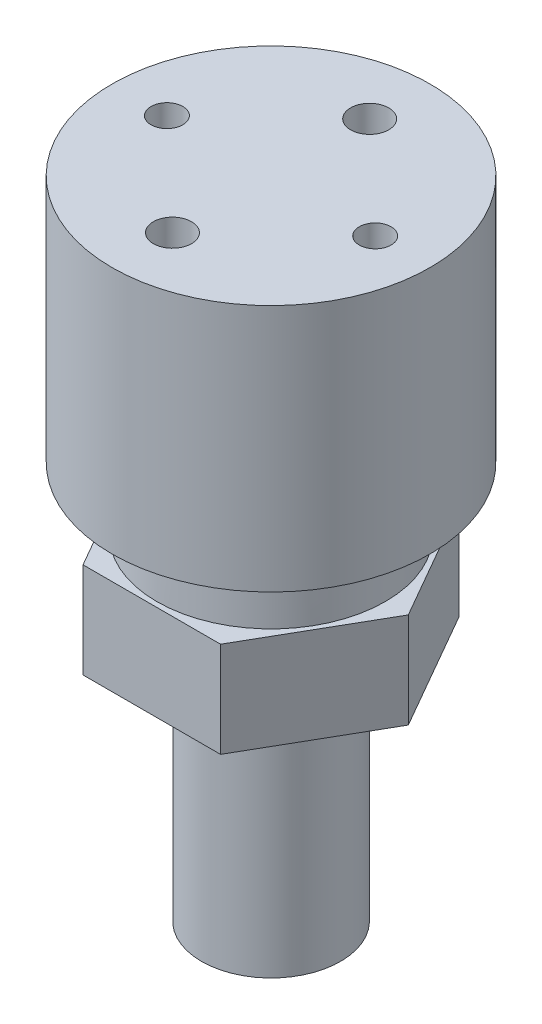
ISO-10303-21;
HEADER;
FILE_DESCRIPTION(('STEP AP214'),'2;1');
FILE_NAME('part.step','',(''),(''),'','','');
FILE_SCHEMA(('AUTOMOTIVE_DESIGN { 1 0 10303 214 1 1 1 1 }'));
ENDSEC;
DATA;
#1=APPLICATION_CONTEXT('core data for automotive mechanical design processes');
#2=APPLICATION_PROTOCOL_DEFINITION('international standard','automotive_design',2000,#1);
#3=PRODUCT_CONTEXT('',#1,'mechanical');
#4=PRODUCT('Part','Part','',(#3));
#5=PRODUCT_RELATED_PRODUCT_CATEGORY('part','',(#4));
#6=PRODUCT_DEFINITION_FORMATION('','',#4);
#7=PRODUCT_DEFINITION_CONTEXT('part definition',#1,'design');
#8=PRODUCT_DEFINITION('design','',#6,#7);
#9=PRODUCT_DEFINITION_SHAPE('','',#8);
#10=(LENGTH_UNIT() NAMED_UNIT(*) SI_UNIT(.MILLI.,.METRE.));
#11=(NAMED_UNIT(*) PLANE_ANGLE_UNIT() SI_UNIT($,.RADIAN.));
#12=(NAMED_UNIT(*) SI_UNIT($,.STERADIAN.) SOLID_ANGLE_UNIT());
#13=UNCERTAINTY_MEASURE_WITH_UNIT(LENGTH_MEASURE(1.E-05),#10,'distance_accuracy_value','');
#14=(GEOMETRIC_REPRESENTATION_CONTEXT(3) GLOBAL_UNCERTAINTY_ASSIGNED_CONTEXT((#13)) GLOBAL_UNIT_ASSIGNED_CONTEXT((#10,
#11,#12)) REPRESENTATION_CONTEXT('',''));
#15=CARTESIAN_POINT('',(0.,0.,0.));
#16=DIRECTION('',(0.,0.,1.));
#17=DIRECTION('',(1.,0.,0.));
#18=AXIS2_PLACEMENT_3D('',#15,#16,#17);
#19=CARTESIAN_POINT('',(-12.7,24.8908107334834,0.));
#20=DIRECTION('',(0.,1.,0.));
#21=DIRECTION('',(0.,0.,1.));
#22=AXIS2_PLACEMENT_3D('',#19,#20,#21);
#23=PLANE('',#22);
#24=CARTESIAN_POINT('',(0.,24.8908107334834,-7.874));
#25=DIRECTION('',(0.,-1.,0.));
#26=DIRECTION('',(0.,0.,-1.));
#27=AXIS2_PLACEMENT_3D('',#24,#25,#26);
#28=CIRCLE('',#27,1.524);
#29=CARTESIAN_POINT('',(0.,24.8908107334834,-9.398));
#30=VERTEX_POINT('',#29);
#31=EDGE_CURVE('E144',#30,#30,#28,.T.);
#32=ORIENTED_EDGE('',*,*,#31,.T.);
#33=EDGE_LOOP('',(#32));
#34=FACE_BOUND('',#33,.T.);
#35=CARTESIAN_POINT('',(8.316893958,24.8908107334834,0.));
#36=DIRECTION('',(0.,1.,0.));
#37=DIRECTION('',(0.,0.,1.));
#38=AXIS2_PLACEMENT_3D('',#35,#36,#37);
#39=CIRCLE('',#38,1.27);
#40=CARTESIAN_POINT('',(8.316893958,24.8908107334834,1.27));
#41=VERTEX_POINT('',#40);
#42=EDGE_CURVE('E150',#41,#41,#39,.T.);
#43=ORIENTED_EDGE('',*,*,#42,.F.);
#44=EDGE_LOOP('',(#43));
#45=FACE_BOUND('',#44,.T.);
#46=CARTESIAN_POINT('',(0.,24.8908107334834,7.874));
#47=DIRECTION('',(0.,1.,0.));
#48=DIRECTION('',(0.,0.,1.));
#49=AXIS2_PLACEMENT_3D('',#46,#47,#48);
#50=CIRCLE('',#49,1.524);
#51=CARTESIAN_POINT('',(0.,24.8908107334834,9.398));
#52=VERTEX_POINT('',#51);
#53=EDGE_CURVE('E156',#52,#52,#50,.T.);
#54=ORIENTED_EDGE('',*,*,#53,.F.);
#55=EDGE_LOOP('',(#54));
#56=FACE_BOUND('',#55,.T.);
#57=CARTESIAN_POINT('',(0.,24.8908107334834,0.));
#58=DIRECTION('',(0.,1.,0.));
#59=DIRECTION('',(0.,0.,1.));
#60=AXIS2_PLACEMENT_3D('',#57,#58,#59);
#61=CIRCLE('',#60,12.7);
#62=CARTESIAN_POINT('',(0.,24.8908107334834,12.7));
#63=VERTEX_POINT('',#62);
#64=EDGE_CURVE('E39',#63,#63,#61,.T.);
#65=ORIENTED_EDGE('',*,*,#64,.T.);
#66=EDGE_LOOP('',(#65));
#67=FACE_BOUND('',#66,.T.);
#68=CARTESIAN_POINT('',(-8.316893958,24.8908107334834,0.));
#69=DIRECTION('',(0.,-1.,0.));
#70=DIRECTION('',(0.,0.,1.));
#71=AXIS2_PLACEMENT_3D('',#68,#69,#70);
#72=CIRCLE('',#71,1.27);
#73=CARTESIAN_POINT('',(-8.316893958,24.8908107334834,1.27));
#74=VERTEX_POINT('',#73);
#75=EDGE_CURVE('E268',#74,#74,#72,.T.);
#76=ORIENTED_EDGE('',*,*,#75,.T.);
#77=EDGE_LOOP('',(#76));
#78=FACE_BOUND('',#77,.T.);
#79=ADVANCED_FACE('F32',(#34,#45,#56,#67,#78),#23,.T.);
#80=CARTESIAN_POINT('',(5.49172751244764,-7.62000000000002,-9.525));
#81=DIRECTION('',(0.,1.,0.));
#82=DIRECTION('',(0.,0.,1.));
#83=AXIS2_PLACEMENT_3D('',#80,#81,#82);
#84=PLANE('',#83);
#85=DIRECTION('',(0.497936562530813,0.,0.867213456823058));
#86=VECTOR('',#85,1.);
#87=CARTESIAN_POINT('',(10.9607913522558,-7.62000000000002,0.));
#88=LINE('',#87,#86);
#89=CARTESIAN_POINT('',(5.49172751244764,-7.62000000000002,-9.525));
#90=VERTEX_POINT('',#89);
#91=CARTESIAN_POINT('',(10.9607913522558,-7.62000000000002,0.));
#92=VERTEX_POINT('',#91);
#93=EDGE_CURVE('E122',#90,#92,#88,.T.);
#94=ORIENTED_EDGE('',*,*,#93,.T.);
#95=DIRECTION('',(-0.497936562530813,0.,0.867213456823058));
#96=VECTOR('',#95,1.);
#97=CARTESIAN_POINT('',(10.9607913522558,-7.62000000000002,0.));
#98=LINE('',#97,#96);
#99=CARTESIAN_POINT('',(5.49172751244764,-7.62000000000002,9.525));
#100=VERTEX_POINT('',#99);
#101=EDGE_CURVE('E99',#92,#100,#98,.T.);
#102=ORIENTED_EDGE('',*,*,#101,.T.);
#103=DIRECTION('',(-1.,0.,0.));
#104=VECTOR('',#103,1.);
#105=CARTESIAN_POINT('',(5.49172751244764,-7.62000000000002,9.525));
#106=LINE('',#105,#104);
#107=CARTESIAN_POINT('',(-5.49172751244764,-7.62000000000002,9.525));
#108=VERTEX_POINT('',#107);
#109=EDGE_CURVE('E125',#100,#108,#106,.T.);
#110=ORIENTED_EDGE('',*,*,#109,.T.);
#111=DIRECTION('',(-0.497936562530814,0.,-0.867213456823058));
#112=VECTOR('',#111,1.);
#113=CARTESIAN_POINT('',(-10.9607913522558,-7.62000000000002,0.));
#114=LINE('',#113,#112);
#115=CARTESIAN_POINT('',(-10.9607913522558,-7.62000000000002,0.));
#116=VERTEX_POINT('',#115);
#117=EDGE_CURVE('E127',#108,#116,#114,.T.);
#118=ORIENTED_EDGE('',*,*,#117,.T.);
#119=DIRECTION('',(0.497936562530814,0.,-0.867213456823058));
#120=VECTOR('',#119,1.);
#121=CARTESIAN_POINT('',(-10.9607913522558,-7.62000000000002,0.));
#122=LINE('',#121,#120);
#123=CARTESIAN_POINT('',(-5.49172751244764,-7.62000000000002,-9.525));
#124=VERTEX_POINT('',#123);
#125=EDGE_CURVE('E51',#116,#124,#122,.T.);
#126=ORIENTED_EDGE('',*,*,#125,.T.);
#127=DIRECTION('',(1.,0.,0.));
#128=VECTOR('',#127,1.);
#129=CARTESIAN_POINT('',(5.49172751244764,-7.62000000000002,-9.525));
#130=LINE('',#129,#128);
#131=EDGE_CURVE('E46',#124,#90,#130,.T.);
#132=ORIENTED_EDGE('',*,*,#131,.T.);
#133=EDGE_LOOP('',(#94,#102,#110,#118,#126,#132));
#134=FACE_BOUND('',#133,.T.);
#135=CARTESIAN_POINT('',(0.,-7.62000000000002,0.));
#136=DIRECTION('',(0.,1.,0.));
#137=DIRECTION('',(0.,0.,1.));
#138=AXIS2_PLACEMENT_3D('',#135,#136,#137);
#139=CIRCLE('',#138,5.55625);
#140=CARTESIAN_POINT('',(0.,-7.62000000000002,5.55625));
#141=VERTEX_POINT('',#140);
#142=EDGE_CURVE('E11',#141,#141,#139,.F.);
#143=ORIENTED_EDGE('',*,*,#142,.F.);
#144=EDGE_LOOP('',(#143));
#145=FACE_BOUND('',#144,.T.);
#146=ADVANCED_FACE('F175',(#134,#145),#84,.F.);
#147=CARTESIAN_POINT('',(0.,55.728152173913,0.));
#148=DIRECTION('',(0.,1.,0.));
#149=DIRECTION('',(0.,0.,1.));
#150=AXIS2_PLACEMENT_3D('',#147,#148,#149);
#151=CYLINDRICAL_SURFACE('',#150,12.7);
#152=CARTESIAN_POINT('',(0.,5.07881073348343,0.));
#153=DIRECTION('',(0.,1.,0.));
#154=DIRECTION('',(0.,0.,1.));
#155=AXIS2_PLACEMENT_3D('',#152,#153,#154);
#156=CIRCLE('',#155,12.7);
#157=CARTESIAN_POINT('',(0.,5.07881073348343,12.7));
#158=VERTEX_POINT('',#157);
#159=EDGE_CURVE('E165',#158,#158,#156,.T.);
#160=ORIENTED_EDGE('',*,*,#159,.T.);
#161=EDGE_LOOP('',(#160));
#162=FACE_BOUND('',#161,.T.);
#163=ORIENTED_EDGE('',*,*,#64,.F.);
#164=EDGE_LOOP('',(#163));
#165=FACE_BOUND('',#164,.T.);
#166=ADVANCED_FACE('F172',(#162,#165),#151,.T.);
#167=CARTESIAN_POINT('',(-9.015021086,5.07881073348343,0.));
#168=DIRECTION('',(0.,-1.,0.));
#169=DIRECTION('',(0.,0.,-1.));
#170=AXIS2_PLACEMENT_3D('',#167,#168,#169);
#171=PLANE('',#170);
#172=CARTESIAN_POINT('',(0.,5.07881073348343,0.));
#173=DIRECTION('',(0.,1.,0.));
#174=DIRECTION('',(0.,0.,1.));
#175=AXIS2_PLACEMENT_3D('',#172,#173,#174);
#176=CIRCLE('',#175,9.015021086);
#177=CARTESIAN_POINT('',(0.,5.07881073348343,9.015021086));
#178=VERTEX_POINT('',#177);
#179=EDGE_CURVE('E162',#178,#178,#176,.T.);
#180=ORIENTED_EDGE('',*,*,#179,.T.);
#181=EDGE_LOOP('',(#180));
#182=FACE_BOUND('',#181,.T.);
#183=ORIENTED_EDGE('',*,*,#159,.F.);
#184=EDGE_LOOP('',(#183));
#185=FACE_BOUND('',#184,.T.);
#186=ADVANCED_FACE('F174',(#182,#185),#171,.T.);
#187=CARTESIAN_POINT('',(0.,5.07881073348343,0.));
#188=DIRECTION('',(0.,-1.,0.));
#189=DIRECTION('',(0.,0.,-1.));
#190=AXIS2_PLACEMENT_3D('',#187,#188,#189);
#191=CONICAL_SURFACE('',#190,9.015021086,0.0216387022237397);
#192=CARTESIAN_POINT('',(0.,0.,0.));
#193=DIRECTION('',(0.,1.,0.));
#194=DIRECTION('',(0.,0.,1.));
#195=AXIS2_PLACEMENT_3D('',#192,#193,#194);
#196=CIRCLE('',#195,9.12493711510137);
#197=CARTESIAN_POINT('',(0.,0.,9.12493711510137));
#198=VERTEX_POINT('',#197);
#199=EDGE_CURVE('E102',#198,#198,#196,.F.);
#200=ORIENTED_EDGE('',*,*,#199,.F.);
#201=EDGE_LOOP('',(#200));
#202=FACE_BOUND('',#201,.T.);
#203=ORIENTED_EDGE('',*,*,#179,.F.);
#204=EDGE_LOOP('',(#203));
#205=FACE_BOUND('',#204,.T.);
#206=ADVANCED_FACE('F181',(#202,#205),#191,.T.);
#207=CARTESIAN_POINT('',(0.,12.1908107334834,7.874));
#208=DIRECTION('',(0.,1.,0.));
#209=DIRECTION('',(0.,0.,1.));
#210=AXIS2_PLACEMENT_3D('',#207,#208,#209);
#211=CYLINDRICAL_SURFACE('',#210,1.524);
#212=CARTESIAN_POINT('',(0.,12.1908107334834,7.874));
#213=DIRECTION('',(0.,1.,0.));
#214=DIRECTION('',(0.,0.,1.));
#215=AXIS2_PLACEMENT_3D('',#212,#213,#214);
#216=CIRCLE('',#215,1.524);
#217=CARTESIAN_POINT('',(0.,12.1908107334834,9.398));
#218=VERTEX_POINT('',#217);
#219=EDGE_CURVE('E159',#218,#218,#216,.T.);
#220=ORIENTED_EDGE('',*,*,#219,.F.);
#221=EDGE_LOOP('',(#220));
#222=FACE_BOUND('',#221,.T.);
#223=ORIENTED_EDGE('',*,*,#53,.T.);
#224=EDGE_LOOP('',(#223));
#225=FACE_BOUND('',#224,.T.);
#226=ADVANCED_FACE('F195',(#222,#225),#211,.F.);
#227=CARTESIAN_POINT('',(0.,12.1908107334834,7.874));
#228=DIRECTION('',(0.,1.,0.));
#229=DIRECTION('',(0.,0.,1.));
#230=AXIS2_PLACEMENT_3D('',#227,#228,#229);
#231=PLANE('',#230);
#232=ORIENTED_EDGE('',*,*,#219,.T.);
#233=EDGE_LOOP('',(#232));
#234=FACE_BOUND('',#233,.T.);
#235=ADVANCED_FACE('F197',(#234),#231,.T.);
#236=CARTESIAN_POINT('',(8.316893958,12.1908107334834,0.));
#237=DIRECTION('',(0.,1.,0.));
#238=DIRECTION('',(0.,0.,1.));
#239=AXIS2_PLACEMENT_3D('',#236,#237,#238);
#240=CYLINDRICAL_SURFACE('',#239,1.27);
#241=CARTESIAN_POINT('',(8.316893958,12.1908107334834,0.));
#242=DIRECTION('',(0.,1.,0.));
#243=DIRECTION('',(0.,0.,1.));
#244=AXIS2_PLACEMENT_3D('',#241,#242,#243);
#245=CIRCLE('',#244,1.27);
#246=CARTESIAN_POINT('',(8.316893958,12.1908107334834,1.27));
#247=VERTEX_POINT('',#246);
#248=EDGE_CURVE('E153',#247,#247,#245,.T.);
#249=ORIENTED_EDGE('',*,*,#248,.F.);
#250=EDGE_LOOP('',(#249));
#251=FACE_BOUND('',#250,.T.);
#252=ORIENTED_EDGE('',*,*,#42,.T.);
#253=EDGE_LOOP('',(#252));
#254=FACE_BOUND('',#253,.T.);
#255=ADVANCED_FACE('F204',(#251,#254),#240,.F.);
#256=CARTESIAN_POINT('',(8.316893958,12.1908107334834,0.));
#257=DIRECTION('',(0.,1.,0.));
#258=DIRECTION('',(0.,0.,1.));
#259=AXIS2_PLACEMENT_3D('',#256,#257,#258);
#260=PLANE('',#259);
#261=ORIENTED_EDGE('',*,*,#248,.T.);
#262=EDGE_LOOP('',(#261));
#263=FACE_BOUND('',#262,.T.);
#264=ADVANCED_FACE('F213',(#263),#260,.T.);
#265=CARTESIAN_POINT('',(0.,12.1908107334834,-7.874));
#266=DIRECTION('',(0.,1.,0.));
#267=DIRECTION('',(0.,0.,1.));
#268=AXIS2_PLACEMENT_3D('',#265,#266,#267);
#269=CYLINDRICAL_SURFACE('',#268,1.524);
#270=CARTESIAN_POINT('',(0.,12.1908107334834,-7.874));
#271=DIRECTION('',(0.,-1.,0.));
#272=DIRECTION('',(0.,0.,-1.));
#273=AXIS2_PLACEMENT_3D('',#270,#271,#272);
#274=CIRCLE('',#273,1.524);
#275=CARTESIAN_POINT('',(0.,12.1908107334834,-9.398));
#276=VERTEX_POINT('',#275);
#277=EDGE_CURVE('E147',#276,#276,#274,.T.);
#278=ORIENTED_EDGE('',*,*,#277,.T.);
#279=EDGE_LOOP('',(#278));
#280=FACE_BOUND('',#279,.T.);
#281=ORIENTED_EDGE('',*,*,#31,.F.);
#282=EDGE_LOOP('',(#281));
#283=FACE_BOUND('',#282,.T.);
#284=ADVANCED_FACE('F217',(#280,#283),#269,.F.);
#285=CARTESIAN_POINT('',(0.,12.1908107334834,-7.874));
#286=DIRECTION('',(0.,1.,0.));
#287=DIRECTION('',(0.,0.,-1.));
#288=AXIS2_PLACEMENT_3D('',#285,#286,#287);
#289=PLANE('',#288);
#290=ORIENTED_EDGE('',*,*,#277,.F.);
#291=EDGE_LOOP('',(#290));
#292=FACE_BOUND('',#291,.T.);
#293=ADVANCED_FACE('F221',(#292),#289,.T.);
#294=CARTESIAN_POINT('',(10.9607913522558,-7.62000000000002,0.));
#295=DIRECTION('',(-0.867213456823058,0.,0.497936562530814));
#296=DIRECTION('',(0.497936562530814,0.,0.867213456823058));
#297=AXIS2_PLACEMENT_3D('',#294,#295,#296);
#298=PLANE('',#297);
#299=DIRECTION('',(0.497936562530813,0.,0.867213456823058));
#300=VECTOR('',#299,1.);
#301=CARTESIAN_POINT('',(10.9607913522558,0.,0.));
#302=LINE('',#301,#300);
#303=CARTESIAN_POINT('',(5.49172751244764,0.,-9.525));
#304=VERTEX_POINT('',#303);
#305=CARTESIAN_POINT('',(10.9607913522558,0.,0.));
#306=VERTEX_POINT('',#305);
#307=EDGE_CURVE('E89',#304,#306,#302,.T.);
#308=ORIENTED_EDGE('',*,*,#307,.T.);
#309=DIRECTION('',(0.,1.,0.));
#310=VECTOR('',#309,1.);
#311=CARTESIAN_POINT('',(10.9607913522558,-7.62000000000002,0.));
#312=LINE('',#311,#310);
#313=EDGE_CURVE('E97',#92,#306,#312,.T.);
#314=ORIENTED_EDGE('',*,*,#313,.F.);
#315=ORIENTED_EDGE('',*,*,#93,.F.);
#316=DIRECTION('',(0.,1.,0.));
#317=VECTOR('',#316,1.);
#318=CARTESIAN_POINT('',(5.49172751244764,-7.62000000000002,-9.525));
#319=LINE('',#318,#317);
#320=EDGE_CURVE('E107',#90,#304,#319,.T.);
#321=ORIENTED_EDGE('',*,*,#320,.T.);
#322=EDGE_LOOP('',(#308,#314,#315,#321));
#323=FACE_BOUND('',#322,.T.);
#324=ADVANCED_FACE('F106',(#323),#298,.F.);
#325=CARTESIAN_POINT('',(10.9607913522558,-7.62000000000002,0.));
#326=DIRECTION('',(-0.867213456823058,0.,-0.497936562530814));
#327=DIRECTION('',(-0.497936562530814,0.,0.867213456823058));
#328=AXIS2_PLACEMENT_3D('',#325,#326,#327);
#329=PLANE('',#328);
#330=DIRECTION('',(-0.497936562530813,0.,0.867213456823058));
#331=VECTOR('',#330,1.);
#332=CARTESIAN_POINT('',(10.9607913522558,0.,0.));
#333=LINE('',#332,#331);
#334=CARTESIAN_POINT('',(5.49172751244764,0.,9.525));
#335=VERTEX_POINT('',#334);
#336=EDGE_CURVE('E84',#306,#335,#333,.T.);
#337=ORIENTED_EDGE('',*,*,#336,.T.);
#338=DIRECTION('',(0.,1.,0.));
#339=VECTOR('',#338,1.);
#340=CARTESIAN_POINT('',(5.49172751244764,-7.62000000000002,9.525));
#341=LINE('',#340,#339);
#342=EDGE_CURVE('E103',#100,#335,#341,.T.);
#343=ORIENTED_EDGE('',*,*,#342,.F.);
#344=ORIENTED_EDGE('',*,*,#101,.F.);
#345=ORIENTED_EDGE('',*,*,#313,.T.);
#346=EDGE_LOOP('',(#337,#343,#344,#345));
#347=FACE_BOUND('',#346,.T.);
#348=ADVANCED_FACE('F98',(#347),#329,.F.);
#349=CARTESIAN_POINT('',(5.49172751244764,-7.62000000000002,9.525));
#350=DIRECTION('',(0.,0.,-1.));
#351=DIRECTION('',(-1.,0.,0.));
#352=AXIS2_PLACEMENT_3D('',#349,#350,#351);
#353=PLANE('',#352);
#354=DIRECTION('',(-1.,0.,0.));
#355=VECTOR('',#354,1.);
#356=CARTESIAN_POINT('',(5.49172751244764,0.,9.525));
#357=LINE('',#356,#355);
#358=CARTESIAN_POINT('',(-5.49172751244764,0.,9.525));
#359=VERTEX_POINT('',#358);
#360=EDGE_CURVE('E91',#335,#359,#357,.T.);
#361=ORIENTED_EDGE('',*,*,#360,.T.);
#362=DIRECTION('',(0.,1.,0.));
#363=VECTOR('',#362,1.);
#364=CARTESIAN_POINT('',(-5.49172751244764,-7.62000000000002,9.525));
#365=LINE('',#364,#363);
#366=EDGE_CURVE('E138',#108,#359,#365,.T.);
#367=ORIENTED_EDGE('',*,*,#366,.F.);
#368=ORIENTED_EDGE('',*,*,#109,.F.);
#369=ORIENTED_EDGE('',*,*,#342,.T.);
#370=EDGE_LOOP('',(#361,#367,#368,#369));
#371=FACE_BOUND('',#370,.T.);
#372=ADVANCED_FACE('F230',(#371),#353,.F.);
#373=CARTESIAN_POINT('',(-10.9607913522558,-7.62000000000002,0.));
#374=DIRECTION('',(0.867213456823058,0.,-0.497936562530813));
#375=DIRECTION('',(-0.497936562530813,0.,-0.867213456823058));
#376=AXIS2_PLACEMENT_3D('',#373,#374,#375);
#377=PLANE('',#376);
#378=DIRECTION('',(-0.497936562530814,0.,-0.867213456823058));
#379=VECTOR('',#378,1.);
#380=CARTESIAN_POINT('',(-10.9607913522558,0.,0.));
#381=LINE('',#380,#379);
#382=CARTESIAN_POINT('',(-10.9607913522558,0.,0.));
#383=VERTEX_POINT('',#382);
#384=EDGE_CURVE('E116',#359,#383,#381,.T.);
#385=ORIENTED_EDGE('',*,*,#384,.T.);
#386=DIRECTION('',(0.,1.,0.));
#387=VECTOR('',#386,1.);
#388=CARTESIAN_POINT('',(-10.9607913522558,-7.62000000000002,0.));
#389=LINE('',#388,#387);
#390=EDGE_CURVE('E135',#116,#383,#389,.T.);
#391=ORIENTED_EDGE('',*,*,#390,.F.);
#392=ORIENTED_EDGE('',*,*,#117,.F.);
#393=ORIENTED_EDGE('',*,*,#366,.T.);
#394=EDGE_LOOP('',(#385,#391,#392,#393));
#395=FACE_BOUND('',#394,.T.);
#396=ADVANCED_FACE('F233',(#395),#377,.F.);
#397=CARTESIAN_POINT('',(-10.9607913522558,-7.62000000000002,0.));
#398=DIRECTION('',(0.867213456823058,0.,0.497936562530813));
#399=DIRECTION('',(0.497936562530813,0.,-0.867213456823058));
#400=AXIS2_PLACEMENT_3D('',#397,#398,#399);
#401=PLANE('',#400);
#402=DIRECTION('',(0.497936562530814,0.,-0.867213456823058));
#403=VECTOR('',#402,1.);
#404=CARTESIAN_POINT('',(-10.9607913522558,0.,0.));
#405=LINE('',#404,#403);
#406=CARTESIAN_POINT('',(-5.49172751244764,0.,-9.525));
#407=VERTEX_POINT('',#406);
#408=EDGE_CURVE('E118',#383,#407,#405,.T.);
#409=ORIENTED_EDGE('',*,*,#408,.T.);
#410=DIRECTION('',(0.,1.,0.));
#411=VECTOR('',#410,1.);
#412=CARTESIAN_POINT('',(-5.49172751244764,-7.62000000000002,-9.525));
#413=LINE('',#412,#411);
#414=EDGE_CURVE('E132',#124,#407,#413,.T.);
#415=ORIENTED_EDGE('',*,*,#414,.F.);
#416=ORIENTED_EDGE('',*,*,#125,.F.);
#417=ORIENTED_EDGE('',*,*,#390,.T.);
#418=EDGE_LOOP('',(#409,#415,#416,#417));
#419=FACE_BOUND('',#418,.T.);
#420=ADVANCED_FACE('F237',(#419),#401,.F.);
#421=CARTESIAN_POINT('',(5.49172751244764,-7.62000000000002,-9.525));
#422=DIRECTION('',(0.,0.,1.));
#423=DIRECTION('',(1.,0.,0.));
#424=AXIS2_PLACEMENT_3D('',#421,#422,#423);
#425=PLANE('',#424);
#426=DIRECTION('',(1.,0.,0.));
#427=VECTOR('',#426,1.);
#428=CARTESIAN_POINT('',(5.49172751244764,0.,-9.525));
#429=LINE('',#428,#427);
#430=EDGE_CURVE('E120',#407,#304,#429,.T.);
#431=ORIENTED_EDGE('',*,*,#430,.T.);
#432=ORIENTED_EDGE('',*,*,#320,.F.);
#433=ORIENTED_EDGE('',*,*,#131,.F.);
#434=ORIENTED_EDGE('',*,*,#414,.T.);
#435=EDGE_LOOP('',(#431,#432,#433,#434));
#436=FACE_BOUND('',#435,.T.);
#437=ADVANCED_FACE('F241',(#436),#425,.F.);
#438=CARTESIAN_POINT('',(5.49172751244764,0.,-9.525));
#439=DIRECTION('',(0.,1.,0.));
#440=DIRECTION('',(0.,0.,1.));
#441=AXIS2_PLACEMENT_3D('',#438,#439,#440);
#442=PLANE('',#441);
#443=ORIENTED_EDGE('',*,*,#199,.T.);
#444=EDGE_LOOP('',(#443));
#445=FACE_BOUND('',#444,.T.);
#446=ORIENTED_EDGE('',*,*,#307,.F.);
#447=ORIENTED_EDGE('',*,*,#430,.F.);
#448=ORIENTED_EDGE('',*,*,#408,.F.);
#449=ORIENTED_EDGE('',*,*,#384,.F.);
#450=ORIENTED_EDGE('',*,*,#360,.F.);
#451=ORIENTED_EDGE('',*,*,#336,.F.);
#452=EDGE_LOOP('',(#446,#447,#448,#449,#450,#451));
#453=FACE_BOUND('',#452,.T.);
#454=ADVANCED_FACE('F86',(#445,#453),#442,.T.);
#455=CARTESIAN_POINT('',(0.,-26.67,0.));
#456=DIRECTION('',(0.,1.,0.));
#457=DIRECTION('',(0.,0.,1.));
#458=AXIS2_PLACEMENT_3D('',#455,#456,#457);
#459=CYLINDRICAL_SURFACE('',#458,5.55625);
#460=CARTESIAN_POINT('',(0.,-26.67,0.));
#461=DIRECTION('',(0.,-1.,0.));
#462=DIRECTION('',(0.,0.,-1.));
#463=AXIS2_PLACEMENT_3D('',#460,#461,#462);
#464=CIRCLE('',#463,5.55625);
#465=CARTESIAN_POINT('',(0.,-26.67,5.55625));
#466=VERTEX_POINT('',#465);
#467=EDGE_CURVE('E108',#466,#466,#464,.T.);
#468=CARTESIAN_POINT('',(0.,-26.67,5.55625));
#469=CARTESIAN_POINT('',(0.,-26.4715625,5.55625));
#470=CARTESIAN_POINT('',(0.,-26.273125,5.55625));
#471=CARTESIAN_POINT('',(0.,-25.87625,5.55625));
#472=CARTESIAN_POINT('',(0.,-25.6778125,5.55625));
#473=CARTESIAN_POINT('',(0.,-25.2809375,5.55625));
#474=CARTESIAN_POINT('',(0.,-25.0825,5.55625));
#475=CARTESIAN_POINT('',(0.,-24.685625,5.55625));
#476=CARTESIAN_POINT('',(0.,-24.4871875,5.55625));
#477=CARTESIAN_POINT('',(0.,-24.0903125,5.55625));
#478=CARTESIAN_POINT('',(0.,-23.891875,5.55625));
#479=CARTESIAN_POINT('',(0.,-23.495,5.55625));
#480=CARTESIAN_POINT('',(0.,-23.2965625,5.55625));
#481=CARTESIAN_POINT('',(0.,-22.8996875,5.55625));
#482=CARTESIAN_POINT('',(0.,-22.70125,5.55625));
#483=CARTESIAN_POINT('',(0.,-22.304375,5.55625));
#484=CARTESIAN_POINT('',(0.,-22.1059375,5.55625));
#485=CARTESIAN_POINT('',(0.,-21.7090625,5.55625));
#486=CARTESIAN_POINT('',(0.,-21.510625,5.55625));
#487=CARTESIAN_POINT('',(0.,-21.11375,5.55625));
#488=CARTESIAN_POINT('',(0.,-20.9153125,5.55625));
#489=CARTESIAN_POINT('',(0.,-20.5184375,5.55625));
#490=CARTESIAN_POINT('',(0.,-20.32,5.55625));
#491=CARTESIAN_POINT('',(0.,-19.923125,5.55625));
#492=CARTESIAN_POINT('',(0.,-19.7246875,5.55625));
#493=CARTESIAN_POINT('',(0.,-19.3278125,5.55625));
#494=CARTESIAN_POINT('',(0.,-19.129375,5.55625));
#495=CARTESIAN_POINT('',(0.,-18.7325,5.55625));
#496=CARTESIAN_POINT('',(0.,-18.5340625,5.55625));
#497=CARTESIAN_POINT('',(0.,-18.1371875,5.55625));
#498=CARTESIAN_POINT('',(0.,-17.93875,5.55625));
#499=CARTESIAN_POINT('',(0.,-17.541875,5.55625));
#500=CARTESIAN_POINT('',(0.,-17.3434375,5.55625));
#501=CARTESIAN_POINT('',(0.,-16.9465625,5.55625));
#502=CARTESIAN_POINT('',(0.,-16.748125,5.55625));
#503=CARTESIAN_POINT('',(0.,-16.35125,5.55625));
#504=CARTESIAN_POINT('',(0.,-16.1528125,5.55625));
#505=CARTESIAN_POINT('',(0.,-15.7559375,5.55625));
#506=CARTESIAN_POINT('',(0.,-15.5575,5.55625));
#507=CARTESIAN_POINT('',(0.,-15.160625,5.55625));
#508=CARTESIAN_POINT('',(0.,-14.9621875,5.55625));
#509=CARTESIAN_POINT('',(0.,-14.5653125,5.55625));
#510=CARTESIAN_POINT('',(0.,-14.366875,5.55625));
#511=CARTESIAN_POINT('',(0.,-13.97,5.55625));
#512=CARTESIAN_POINT('',(0.,-13.7715625,5.55625));
#513=CARTESIAN_POINT('',(0.,-13.3746875,5.55625));
#514=CARTESIAN_POINT('',(0.,-13.17625,5.55625));
#515=CARTESIAN_POINT('',(0.,-12.779375,5.55625));
#516=CARTESIAN_POINT('',(0.,-12.5809375,5.55625));
#517=CARTESIAN_POINT('',(0.,-12.1840625,5.55625));
#518=CARTESIAN_POINT('',(0.,-11.985625,5.55625));
#519=CARTESIAN_POINT('',(0.,-11.58875,5.55625));
#520=CARTESIAN_POINT('',(0.,-11.3903125,5.55625));
#521=CARTESIAN_POINT('',(0.,-10.9934375,5.55625));
#522=CARTESIAN_POINT('',(0.,-10.795,5.55625));
#523=CARTESIAN_POINT('',(0.,-10.398125,5.55625));
#524=CARTESIAN_POINT('',(0.,-10.1996875,5.55625));
#525=CARTESIAN_POINT('',(0.,-9.80281250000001,5.55625));
#526=CARTESIAN_POINT('',(0.,-9.60437500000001,5.55625));
#527=CARTESIAN_POINT('',(0.,-9.20750000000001,5.55625));
#528=CARTESIAN_POINT('',(0.,-9.00906250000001,5.55625));
#529=CARTESIAN_POINT('',(0.,-8.61218750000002,5.55625));
#530=CARTESIAN_POINT('',(0.,-8.41375000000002,5.55625));
#531=CARTESIAN_POINT('',(0.,-8.01687500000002,5.55625));
#532=CARTESIAN_POINT('',(0.,-7.81843750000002,5.55625));
#533=CARTESIAN_POINT('',(0.,-7.62000000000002,5.55625));
#534=B_SPLINE_CURVE_WITH_KNOTS('',3,(#468,#469,#470,#471,#472,#473,#474,#475,#476,#477,#478,
#479,#480,#481,#482,#483,#484,#485,#486,#487,#488,#489,#490,#491,#492,#493,#494,#495,#496,#497,
#498,#499,#500,#501,#502,#503,#504,#505,#506,#507,#508,#509,#510,#511,#512,#513,#514,#515,#516,
#517,#518,#519,#520,#521,#522,#523,#524,#525,#526,#527,#528,#529,#530,#531,#532,#533),
.UNSPECIFIED.,.F.,.F.,(4,2,2,2,2,2,2,2,2,2,2,2,2,2,2,2,2,2,2,2,2,2,2,2,2,2,2,2,2,2,2,2,4),(0.,
0.595312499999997,1.19062499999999,1.78593749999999,2.38124999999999,2.97656249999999,
3.57187499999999,4.16718749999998,4.76249999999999,5.35781249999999,5.95312499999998,
6.54843749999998,7.14374999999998,7.73906249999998,8.33437499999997,8.92968749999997,
9.52499999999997,10.1203125,10.715625,11.3109375,11.90625,12.5015625,13.096875,13.6921875,
14.2875,14.8828125,15.478125,16.0734375,16.66875,17.2640625,17.859375,18.4546875,
19.0499999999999),.UNSPECIFIED.);
#535=EDGE_CURVE('BSEAM248',#466,#141,#534,.T.);
#536=ORIENTED_EDGE('',*,*,#467,.F.);
#537=ORIENTED_EDGE('',*,*,#142,.T.);
#538=ORIENTED_EDGE('',*,*,#535,.T.);
#539=ORIENTED_EDGE('',*,*,#535,.F.);
#540=EDGE_LOOP('',(#536,#538,#537,#539));
#541=FACE_BOUND('',#540,.T.);
#542=ADVANCED_FACE('F248',(#541),#459,.T.);
#543=CARTESIAN_POINT('',(0.,-26.67,0.));
#544=DIRECTION('',(0.,-1.,0.));
#545=DIRECTION('',(0.,0.,-1.));
#546=AXIS2_PLACEMENT_3D('',#543,#544,#545);
#547=PLANE('',#546);
#548=ORIENTED_EDGE('',*,*,#467,.T.);
#549=EDGE_LOOP('',(#548));
#550=FACE_BOUND('',#549,.T.);
#551=ADVANCED_FACE('F252',(#550),#547,.T.);
#552=CARTESIAN_POINT('',(-8.316893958,12.1908107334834,0.));
#553=DIRECTION('',(0.,1.,0.));
#554=DIRECTION('',(0.,0.,1.));
#555=AXIS2_PLACEMENT_3D('',#552,#553,#554);
#556=CYLINDRICAL_SURFACE('',#555,1.27);
#557=CARTESIAN_POINT('',(-8.316893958,12.1908107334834,0.));
#558=DIRECTION('',(0.,-1.,0.));
#559=DIRECTION('',(0.,0.,1.));
#560=AXIS2_PLACEMENT_3D('',#557,#558,#559);
#561=CIRCLE('',#560,1.27);
#562=CARTESIAN_POINT('',(-8.316893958,12.1908107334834,1.27));
#563=VERTEX_POINT('',#562);
#564=EDGE_CURVE('E111',#563,#563,#561,.T.);
#565=ORIENTED_EDGE('',*,*,#564,.T.);
#566=EDGE_LOOP('',(#565));
#567=FACE_BOUND('',#566,.T.);
#568=ORIENTED_EDGE('',*,*,#75,.F.);
#569=EDGE_LOOP('',(#568));
#570=FACE_BOUND('',#569,.T.);
#571=ADVANCED_FACE('F256',(#567,#570),#556,.F.);
#572=CARTESIAN_POINT('',(-8.316893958,12.1908107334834,0.));
#573=DIRECTION('',(0.,1.,0.));
#574=DIRECTION('',(0.,0.,1.));
#575=AXIS2_PLACEMENT_3D('',#572,#573,#574);
#576=PLANE('',#575);
#577=ORIENTED_EDGE('',*,*,#564,.F.);
#578=EDGE_LOOP('',(#577));
#579=FACE_BOUND('',#578,.T.);
#580=ADVANCED_FACE('F260',(#579),#576,.T.);
#581=CLOSED_SHELL('',(#79,#146,#166,#186,#206,#226,#235,#255,#264,#284,#293,#324,#348,#372,#396,
#420,#437,#454,#542,#551,#571,#580));
#582=MANIFOLD_SOLID_BREP('B2',#581);
#583=ADVANCED_BREP_SHAPE_REPRESENTATION('',(#18,#582),#14);
#584=SHAPE_DEFINITION_REPRESENTATION(#9,#583);
ENDSEC;
END-ISO-10303-21;
